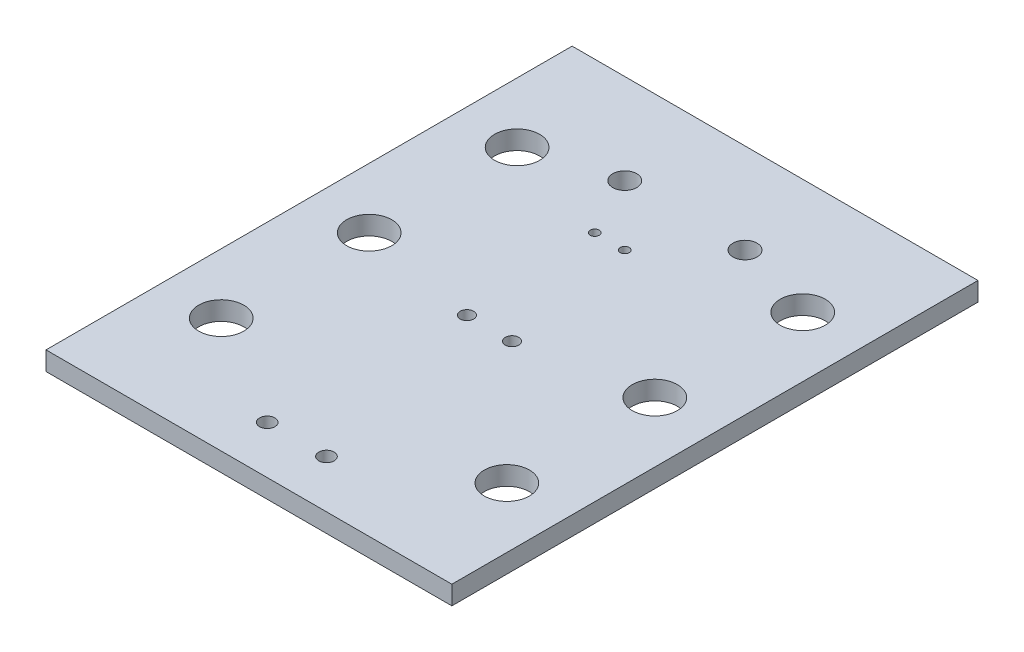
from build123d import *

# Parameters (mm, degrees)
SKETCH1_W           = 34.29
SKETCH1_H           = 44.45
BOSS_EXTRUDE1_DEPTH = 1.5875
SKETCH2_R           = 1.905
SKETCH2_R_2         = 0.6477
SKETCH2_R_3         = 0.5715
SKETCH2_R_4         = 0.381
SKETCH2_R_5         = 1.016
CUT_EXTRUDE1_DEPTH  = 48.668371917


with BuildPart() as part:
    # Sketch1 → Boss-Extrude1 (new body)
    with BuildSketch(Plane(origin=(0, 0, 0), x_dir=(1, 0, 0), z_dir=(0, 1, 0))):
        with Locations((0, 22.225)):
            Rectangle(SKETCH1_W, SKETCH1_H)
    extrude(amount=BOSS_EXTRUDE1_DEPTH)

    # Sketch2 (on Top Plane) → Cut-Extrude1 (cut, through all)
    with BuildSketch(Plane(origin=(0, 0, 0), x_dir=(1, 0, 0), z_dir=(0, 1, 0))):
        with Locations(Location((12.065, 34.7218, 0), (0, 0, 270))):
            Circle(SKETCH2_R)
        with Locations(Location((12.065, 22.225, 0), (0, 0, 270))):
            Circle(SKETCH2_R)
        with Locations(Location((12.065, 9.72566, 0), (0, 0, 270))):
            Circle(SKETCH2_R)
        with Locations(Location((2.5019, 4.04876, 0), (0, 0, 270))):
            Circle(SKETCH2_R_2)
        with Locations(Location((1.905, 20.32, 0), (0, 0, 270))):
            Circle(SKETCH2_R_3)
        with Locations(Location((0, 31.75, 0), (0, 0, 270))):
            Circle(SKETCH2_R_4)
        with Locations(Location((-2.54, 31.75, 0), (0, 0, 270))):
            Circle(SKETCH2_R_4)
        with Locations(Location((5.08, 36.83, 0), (0, 0, 270))):
            Circle(SKETCH2_R_5)
        with Locations(Location((-12.065, 9.72566, 0), (0, 0, 90))):
            Circle(SKETCH2_R)
        with Locations(Location((-2.5019, 4.04876, 0), (0, 0, 90))):
            Circle(SKETCH2_R_2)
        with Locations(Location((-12.065, 22.225, 0), (0, 0, 90))):
            Circle(SKETCH2_R)
        with Locations(Location((-1.905, 20.32, 0), (0, 0, 90))):
            Circle(SKETCH2_R_3)
        with Locations(Location((-12.065, 34.7218, 0), (0, 0, 90))):
            Circle(SKETCH2_R)
        with Locations(Location((-5.08, 36.83, 0), (0, 0, 90))):
            Circle(SKETCH2_R_5)
    extrude(amount=CUT_EXTRUDE1_DEPTH, mode=Mode.SUBTRACT)


solid = part.part
